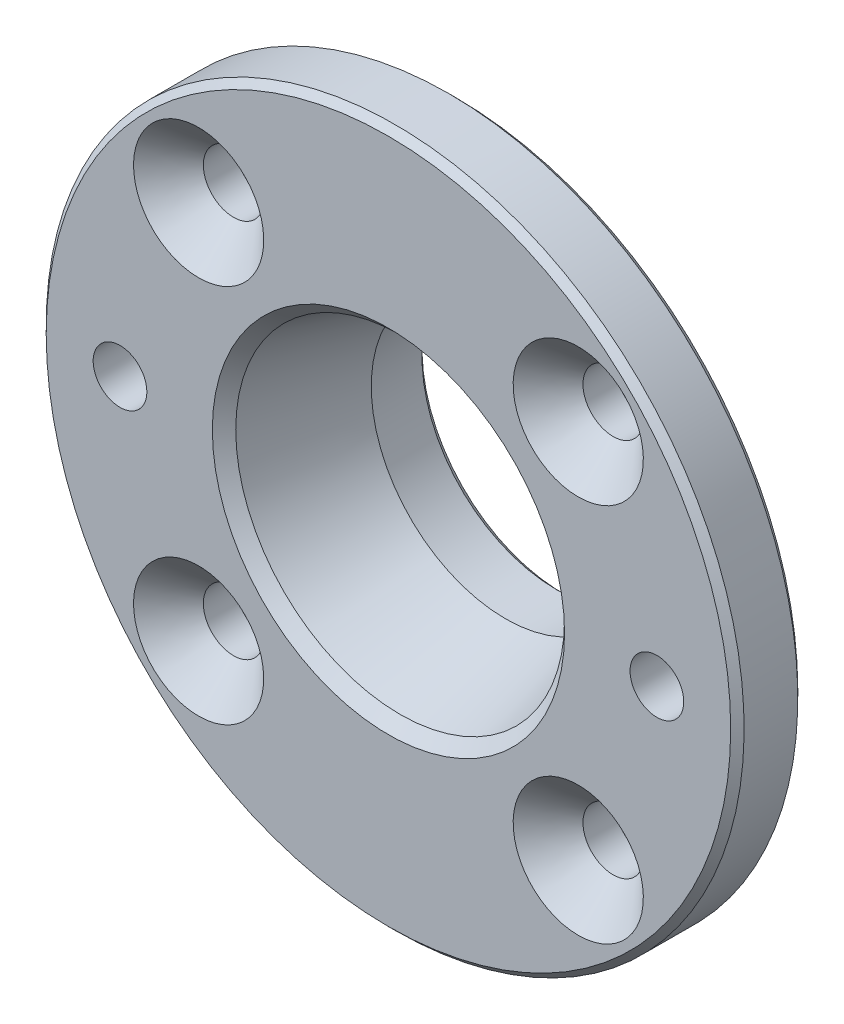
ISO-10303-21;
HEADER;
FILE_DESCRIPTION(('STEP AP214'),'2;1');
FILE_NAME('part.step','',(''),(''),'','','');
FILE_SCHEMA(('AUTOMOTIVE_DESIGN { 1 0 10303 214 1 1 1 1 }'));
ENDSEC;
DATA;
#1=APPLICATION_CONTEXT('core data for automotive mechanical design processes');
#2=APPLICATION_PROTOCOL_DEFINITION('international standard','automotive_design',2000,#1);
#3=PRODUCT_CONTEXT('',#1,'mechanical');
#4=PRODUCT('Part','Part','',(#3));
#5=PRODUCT_RELATED_PRODUCT_CATEGORY('part','',(#4));
#6=PRODUCT_DEFINITION_FORMATION('','',#4);
#7=PRODUCT_DEFINITION_CONTEXT('part definition',#1,'design');
#8=PRODUCT_DEFINITION('design','',#6,#7);
#9=PRODUCT_DEFINITION_SHAPE('','',#8);
#10=(LENGTH_UNIT() NAMED_UNIT(*) SI_UNIT(.MILLI.,.METRE.));
#11=(NAMED_UNIT(*) PLANE_ANGLE_UNIT() SI_UNIT($,.RADIAN.));
#12=(NAMED_UNIT(*) SI_UNIT($,.STERADIAN.) SOLID_ANGLE_UNIT());
#13=UNCERTAINTY_MEASURE_WITH_UNIT(LENGTH_MEASURE(1.E-05),#10,'distance_accuracy_value','');
#14=(GEOMETRIC_REPRESENTATION_CONTEXT(3) GLOBAL_UNCERTAINTY_ASSIGNED_CONTEXT((#13)) GLOBAL_UNIT_ASSIGNED_CONTEXT((#10,
#11,#12)) REPRESENTATION_CONTEXT('',''));
#15=CARTESIAN_POINT('',(0.,0.,0.));
#16=DIRECTION('',(0.,0.,1.));
#17=DIRECTION('',(1.,0.,0.));
#18=AXIS2_PLACEMENT_3D('',#15,#16,#17);
#19=CARTESIAN_POINT('',(0.,0.,-8.71853610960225));
#20=DIRECTION('',(0.,0.,1.));
#21=DIRECTION('',(0.,-1.,0.));
#22=AXIS2_PLACEMENT_3D('',#19,#20,#21);
#23=CONICAL_SURFACE('',#22,10.,0.279252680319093);
#24=CARTESIAN_POINT('',(0.,0.,-8.71853610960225));
#25=DIRECTION('',(0.,0.,1.));
#26=DIRECTION('',(0.,-1.,0.));
#27=AXIS2_PLACEMENT_3D('',#24,#25,#26);
#28=CIRCLE('',#27,10.);
#29=CARTESIAN_POINT('',(0.,-10.,-8.71853610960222));
#30=VERTEX_POINT('',#29);
#31=EDGE_CURVE('E58',#30,#30,#28,.T.);
#32=ORIENTED_EDGE('',*,*,#31,.F.);
#33=EDGE_LOOP('',(#32));
#34=FACE_BOUND('',#33,.T.);
#35=CARTESIAN_POINT('',(0.,0.,-0.871853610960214));
#36=DIRECTION('',(0.,0.,-1.));
#37=DIRECTION('',(-1.,0.,0.));
#38=AXIS2_PLACEMENT_3D('',#35,#36,#37);
#39=CIRCLE('',#38,12.25);
#40=CARTESIAN_POINT('',(-12.25,0.,-0.871853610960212));
#41=VERTEX_POINT('',#40);
#42=EDGE_CURVE('E103',#41,#41,#39,.T.);
#43=ORIENTED_EDGE('',*,*,#42,.F.);
#44=EDGE_LOOP('',(#43));
#45=FACE_BOUND('',#44,.T.);
#46=ADVANCED_FACE('F14',(#34,#45),#23,.F.);
#47=CARTESIAN_POINT('',(0.,0.,0.));
#48=DIRECTION('',(0.,0.,1.));
#49=DIRECTION('',(0.,-1.,0.));
#50=AXIS2_PLACEMENT_3D('',#47,#48,#49);
#51=CYLINDRICAL_SURFACE('',#50,10.);
#52=CARTESIAN_POINT('',(0.,0.,-12.5));
#53=DIRECTION('',(0.,0.,-1.));
#54=DIRECTION('',(0.,1.,0.));
#55=AXIS2_PLACEMENT_3D('',#52,#53,#54);
#56=CIRCLE('',#55,10.);
#57=CARTESIAN_POINT('',(0.,9.99999999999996,-12.5));
#58=VERTEX_POINT('',#57);
#59=EDGE_CURVE('E34',#58,#58,#56,.T.);
#60=ORIENTED_EDGE('',*,*,#59,.T.);
#61=EDGE_LOOP('',(#60));
#62=FACE_BOUND('',#61,.T.);
#63=ORIENTED_EDGE('',*,*,#31,.T.);
#64=EDGE_LOOP('',(#63));
#65=FACE_BOUND('',#64,.T.);
#66=ADVANCED_FACE('F159',(#62,#65),#51,.F.);
#67=CARTESIAN_POINT('',(10.,0.,-13.));
#68=DIRECTION('',(0.,0.,-1.));
#69=DIRECTION('',(0.,1.,0.));
#70=AXIS2_PLACEMENT_3D('',#67,#68,#69);
#71=PLANE('',#70);
#72=CARTESIAN_POINT('',(0.,0.,-13.));
#73=DIRECTION('',(0.,0.,-1.));
#74=DIRECTION('',(0.,1.,0.));
#75=AXIS2_PLACEMENT_3D('',#72,#73,#74);
#76=CIRCLE('',#75,10.5);
#77=CARTESIAN_POINT('',(0.,10.5,-13.));
#78=VERTEX_POINT('',#77);
#79=EDGE_CURVE('E37',#78,#78,#76,.F.);
#80=ORIENTED_EDGE('',*,*,#79,.T.);
#81=EDGE_LOOP('',(#80));
#82=FACE_BOUND('',#81,.T.);
#83=CARTESIAN_POINT('',(0.,0.,-13.));
#84=DIRECTION('',(0.,0.,-1.));
#85=DIRECTION('',(0.,1.,0.));
#86=AXIS2_PLACEMENT_3D('',#83,#84,#85);
#87=CIRCLE('',#86,13.4);
#88=CARTESIAN_POINT('',(0.,13.4,-13.));
#89=VERTEX_POINT('',#88);
#90=EDGE_CURVE('E40',#89,#89,#87,.T.);
#91=ORIENTED_EDGE('',*,*,#90,.T.);
#92=EDGE_LOOP('',(#91));
#93=FACE_BOUND('',#92,.T.);
#94=ADVANCED_FACE('F165',(#82,#93),#71,.T.);
#95=CARTESIAN_POINT('',(0.,0.,0.));
#96=DIRECTION('',(0.,0.,1.));
#97=DIRECTION('',(0.,-1.,0.));
#98=AXIS2_PLACEMENT_3D('',#95,#96,#97);
#99=CYLINDRICAL_SURFACE('',#98,14.);
#100=CARTESIAN_POINT('',(0.,0.,-7.));
#101=DIRECTION('',(0.,0.,1.));
#102=DIRECTION('',(0.,-1.,0.));
#103=AXIS2_PLACEMENT_3D('',#100,#101,#102);
#104=CIRCLE('',#103,14.);
#105=CARTESIAN_POINT('',(0.,-14.,-6.99999999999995));
#106=VERTEX_POINT('',#105);
#107=EDGE_CURVE('E76',#106,#106,#104,.T.);
#108=ORIENTED_EDGE('',*,*,#107,.F.);
#109=EDGE_LOOP('',(#108));
#110=FACE_BOUND('',#109,.T.);
#111=CARTESIAN_POINT('',(0.,0.,-10.9));
#112=DIRECTION('',(0.,0.,1.));
#113=DIRECTION('',(0.,-1.,0.));
#114=AXIS2_PLACEMENT_3D('',#111,#112,#113);
#115=CIRCLE('',#114,14.);
#116=CARTESIAN_POINT('',(0.,-14.,-10.9));
#117=VERTEX_POINT('',#116);
#118=EDGE_CURVE('E61',#117,#117,#115,.T.);
#119=ORIENTED_EDGE('',*,*,#118,.T.);
#120=EDGE_LOOP('',(#119));
#121=FACE_BOUND('',#120,.T.);
#122=ADVANCED_FACE('F173',(#110,#121),#99,.T.);
#123=CARTESIAN_POINT('',(14.,0.,-5.));
#124=DIRECTION('',(0.,0.,-1.));
#125=DIRECTION('',(0.,1.,0.));
#126=AXIS2_PLACEMENT_3D('',#123,#124,#125);
#127=PLANE('',#126);
#128=CARTESIAN_POINT('',(-20.,0.,-5.));
#129=DIRECTION('',(0.,0.,-1.));
#130=DIRECTION('',(0.,1.,0.));
#131=AXIS2_PLACEMENT_3D('',#128,#129,#130);
#132=CIRCLE('',#131,2.);
#133=CARTESIAN_POINT('',(-20.,2.,-5.00000000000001));
#134=VERTEX_POINT('',#133);
#135=EDGE_CURVE('E109',#134,#134,#132,.T.);
#136=ORIENTED_EDGE('',*,*,#135,.F.);
#137=EDGE_LOOP('',(#136));
#138=FACE_BOUND('',#137,.T.);
#139=CARTESIAN_POINT('',(20.,2.8796409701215E-13,-5.));
#140=DIRECTION('',(0.,0.,-1.));
#141=DIRECTION('',(0.,1.,0.));
#142=AXIS2_PLACEMENT_3D('',#139,#140,#141);
#143=CIRCLE('',#142,2.);
#144=CARTESIAN_POINT('',(20.,2.00000000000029,-5.00000000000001));
#145=VERTEX_POINT('',#144);
#146=EDGE_CURVE('E112',#145,#145,#143,.T.);
#147=ORIENTED_EDGE('',*,*,#146,.F.);
#148=EDGE_LOOP('',(#147));
#149=FACE_BOUND('',#148,.T.);
#150=CARTESIAN_POINT('',(14.1421356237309,14.142135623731,-5.));
#151=DIRECTION('',(0.,0.,-1.));
#152=DIRECTION('',(0.,1.,0.));
#153=AXIS2_PLACEMENT_3D('',#150,#151,#152);
#154=CIRCLE('',#153,2.25);
#155=CARTESIAN_POINT('',(14.1421356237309,16.392135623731,-5.00000000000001));
#156=VERTEX_POINT('',#155);
#157=EDGE_CURVE('E9',#156,#156,#154,.T.);
#158=ORIENTED_EDGE('',*,*,#157,.F.);
#159=EDGE_LOOP('',(#158));
#160=FACE_BOUND('',#159,.T.);
#161=CARTESIAN_POINT('',(-14.142135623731,14.1421356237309,-5.));
#162=DIRECTION('',(0.,0.,-1.));
#163=DIRECTION('',(0.,1.,0.));
#164=AXIS2_PLACEMENT_3D('',#161,#162,#163);
#165=CIRCLE('',#164,2.25);
#166=CARTESIAN_POINT('',(-14.142135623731,16.3921356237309,-5.00000000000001));
#167=VERTEX_POINT('',#166);
#168=EDGE_CURVE('E22',#167,#167,#165,.T.);
#169=ORIENTED_EDGE('',*,*,#168,.F.);
#170=EDGE_LOOP('',(#169));
#171=FACE_BOUND('',#170,.T.);
#172=CARTESIAN_POINT('',(-14.1421356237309,-14.142135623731,-5.));
#173=DIRECTION('',(0.,0.,-1.));
#174=DIRECTION('',(0.,1.,0.));
#175=AXIS2_PLACEMENT_3D('',#172,#173,#174);
#176=CIRCLE('',#175,2.25);
#177=CARTESIAN_POINT('',(-14.1421356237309,-11.892135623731,-5.00000000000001));
#178=VERTEX_POINT('',#177);
#179=EDGE_CURVE('E26',#178,#178,#176,.T.);
#180=ORIENTED_EDGE('',*,*,#179,.F.);
#181=EDGE_LOOP('',(#180));
#182=FACE_BOUND('',#181,.T.);
#183=CARTESIAN_POINT('',(14.142135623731,-14.1421356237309,-5.));
#184=DIRECTION('',(0.,0.,-1.));
#185=DIRECTION('',(0.,1.,0.));
#186=AXIS2_PLACEMENT_3D('',#183,#184,#185);
#187=CIRCLE('',#186,2.25);
#188=CARTESIAN_POINT('',(14.142135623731,-11.8921356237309,-5.00000000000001));
#189=VERTEX_POINT('',#188);
#190=EDGE_CURVE('E31',#189,#189,#187,.T.);
#191=ORIENTED_EDGE('',*,*,#190,.F.);
#192=EDGE_LOOP('',(#191));
#193=FACE_BOUND('',#192,.T.);
#194=CARTESIAN_POINT('',(0.,0.,-5.));
#195=DIRECTION('',(0.,0.,1.));
#196=DIRECTION('',(0.,-1.,0.));
#197=AXIS2_PLACEMENT_3D('',#194,#195,#196);
#198=CIRCLE('',#197,15.);
#199=CARTESIAN_POINT('',(0.,-15.,-4.99999999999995));
#200=VERTEX_POINT('',#199);
#201=EDGE_CURVE('E67',#200,#200,#198,.T.);
#202=ORIENTED_EDGE('',*,*,#201,.T.);
#203=EDGE_LOOP('',(#202));
#204=FACE_BOUND('',#203,.T.);
#205=CARTESIAN_POINT('',(0.,0.,-5.));
#206=DIRECTION('',(0.,0.,-1.));
#207=DIRECTION('',(0.,1.,0.));
#208=AXIS2_PLACEMENT_3D('',#205,#206,#207);
#209=CIRCLE('',#208,25.5);
#210=CARTESIAN_POINT('',(0.,25.5,-5.00000000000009));
#211=VERTEX_POINT('',#210);
#212=EDGE_CURVE('E46',#211,#211,#209,.T.);
#213=ORIENTED_EDGE('',*,*,#212,.T.);
#214=EDGE_LOOP('',(#213));
#215=FACE_BOUND('',#214,.T.);
#216=ADVANCED_FACE('F177',(#138,#149,#160,#171,#182,#193,#204,#215),#127,.T.);
#217=CARTESIAN_POINT('',(0.,0.,0.));
#218=DIRECTION('',(0.,0.,1.));
#219=DIRECTION('',(0.,-1.,0.));
#220=AXIS2_PLACEMENT_3D('',#217,#218,#219);
#221=CYLINDRICAL_SURFACE('',#220,26.);
#222=CARTESIAN_POINT('',(0.,0.,-0.500000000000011));
#223=DIRECTION('',(0.,0.,1.));
#224=DIRECTION('',(0.,-1.,0.));
#225=AXIS2_PLACEMENT_3D('',#222,#223,#224);
#226=CIRCLE('',#225,26.);
#227=CARTESIAN_POINT('',(0.,-26.,-0.49999999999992));
#228=VERTEX_POINT('',#227);
#229=EDGE_CURVE('E49',#228,#228,#226,.F.);
#230=ORIENTED_EDGE('',*,*,#229,.T.);
#231=EDGE_LOOP('',(#230));
#232=FACE_BOUND('',#231,.T.);
#233=CARTESIAN_POINT('',(0.,0.,-4.5));
#234=DIRECTION('',(0.,0.,-1.));
#235=DIRECTION('',(0.,1.,0.));
#236=AXIS2_PLACEMENT_3D('',#233,#234,#235);
#237=CIRCLE('',#236,26.);
#238=CARTESIAN_POINT('',(0.,26.,-4.50000000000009));
#239=VERTEX_POINT('',#238);
#240=EDGE_CURVE('E52',#239,#239,#237,.F.);
#241=ORIENTED_EDGE('',*,*,#240,.T.);
#242=EDGE_LOOP('',(#241));
#243=FACE_BOUND('',#242,.T.);
#244=ADVANCED_FACE('F128',(#232,#243),#221,.T.);
#245=CARTESIAN_POINT('',(12.5,0.,0.));
#246=DIRECTION('',(0.,0.,1.));
#247=DIRECTION('',(0.,-1.,0.));
#248=AXIS2_PLACEMENT_3D('',#245,#246,#247);
#249=PLANE('',#248);
#250=CARTESIAN_POINT('',(-20.,0.,0.));
#251=DIRECTION('',(0.,0.,1.));
#252=DIRECTION('',(1.,0.,0.));
#253=AXIS2_PLACEMENT_3D('',#250,#251,#252);
#254=CIRCLE('',#253,2.);
#255=CARTESIAN_POINT('',(-18.,0.,0.));
#256=VERTEX_POINT('',#255);
#257=EDGE_CURVE('E115',#256,#256,#254,.T.);
#258=ORIENTED_EDGE('',*,*,#257,.F.);
#259=EDGE_LOOP('',(#258));
#260=FACE_BOUND('',#259,.T.);
#261=CARTESIAN_POINT('',(20.,2.8796409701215E-13,0.));
#262=DIRECTION('',(0.,0.,1.));
#263=DIRECTION('',(1.,0.,0.));
#264=AXIS2_PLACEMENT_3D('',#261,#262,#263);
#265=CIRCLE('',#264,2.);
#266=CARTESIAN_POINT('',(22.,2.8796409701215E-13,0.));
#267=VERTEX_POINT('',#266);
#268=EDGE_CURVE('E116',#267,#267,#265,.T.);
#269=ORIENTED_EDGE('',*,*,#268,.F.);
#270=EDGE_LOOP('',(#269));
#271=FACE_BOUND('',#270,.T.);
#272=CARTESIAN_POINT('',(0.,0.,0.));
#273=DIRECTION('',(0.,0.,-1.));
#274=DIRECTION('',(-1.,0.,0.));
#275=AXIS2_PLACEMENT_3D('',#272,#273,#274);
#276=CIRCLE('',#275,13.1218536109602);
#277=CARTESIAN_POINT('',(-13.1218536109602,0.,0.));
#278=VERTEX_POINT('',#277);
#279=EDGE_CURVE('E106',#278,#278,#276,.T.);
#280=ORIENTED_EDGE('',*,*,#279,.T.);
#281=EDGE_LOOP('',(#280));
#282=FACE_BOUND('',#281,.T.);
#283=CARTESIAN_POINT('',(14.1421356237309,14.142135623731,0.));
#284=DIRECTION('',(0.,0.,1.));
#285=DIRECTION('',(0.,-1.,0.));
#286=AXIS2_PLACEMENT_3D('',#283,#284,#285);
#287=CIRCLE('',#286,4.85);
#288=CARTESIAN_POINT('',(14.1421356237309,9.29213562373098,0.));
#289=VERTEX_POINT('',#288);
#290=EDGE_CURVE('E100',#289,#289,#287,.T.);
#291=ORIENTED_EDGE('',*,*,#290,.F.);
#292=EDGE_LOOP('',(#291));
#293=FACE_BOUND('',#292,.T.);
#294=CARTESIAN_POINT('',(14.142135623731,-14.1421356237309,0.));
#295=DIRECTION('',(0.,0.,1.));
#296=DIRECTION('',(0.,-1.,0.));
#297=AXIS2_PLACEMENT_3D('',#294,#295,#296);
#298=CIRCLE('',#297,4.85);
#299=CARTESIAN_POINT('',(14.142135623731,-18.9921356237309,0.));
#300=VERTEX_POINT('',#299);
#301=EDGE_CURVE('E94',#300,#300,#298,.T.);
#302=ORIENTED_EDGE('',*,*,#301,.F.);
#303=EDGE_LOOP('',(#302));
#304=FACE_BOUND('',#303,.T.);
#305=CARTESIAN_POINT('',(-14.1421356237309,-14.142135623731,0.));
#306=DIRECTION('',(0.,0.,1.));
#307=DIRECTION('',(0.,-1.,0.));
#308=AXIS2_PLACEMENT_3D('',#305,#306,#307);
#309=CIRCLE('',#308,4.85);
#310=CARTESIAN_POINT('',(-14.1421356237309,-18.992135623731,0.));
#311=VERTEX_POINT('',#310);
#312=EDGE_CURVE('E88',#311,#311,#309,.T.);
#313=ORIENTED_EDGE('',*,*,#312,.F.);
#314=EDGE_LOOP('',(#313));
#315=FACE_BOUND('',#314,.T.);
#316=CARTESIAN_POINT('',(-14.142135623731,14.1421356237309,0.));
#317=DIRECTION('',(0.,0.,1.));
#318=DIRECTION('',(0.,-1.,0.));
#319=AXIS2_PLACEMENT_3D('',#316,#317,#318);
#320=CIRCLE('',#319,4.85);
#321=CARTESIAN_POINT('',(-14.142135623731,9.29213562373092,0.));
#322=VERTEX_POINT('',#321);
#323=EDGE_CURVE('E82',#322,#322,#320,.T.);
#324=ORIENTED_EDGE('',*,*,#323,.F.);
#325=EDGE_LOOP('',(#324));
#326=FACE_BOUND('',#325,.T.);
#327=CARTESIAN_POINT('',(0.,0.,0.));
#328=DIRECTION('',(0.,0.,1.));
#329=DIRECTION('',(0.,-1.,0.));
#330=AXIS2_PLACEMENT_3D('',#327,#328,#329);
#331=CIRCLE('',#330,25.5);
#332=CARTESIAN_POINT('',(0.,-25.5,0.));
#333=VERTEX_POINT('',#332);
#334=EDGE_CURVE('E55',#333,#333,#331,.T.);
#335=ORIENTED_EDGE('',*,*,#334,.T.);
#336=EDGE_LOOP('',(#335));
#337=FACE_BOUND('',#336,.T.);
#338=ADVANCED_FACE('F124',(#260,#271,#282,#293,#304,#315,#326,#337),#249,.T.);
#339=CARTESIAN_POINT('',(0.,0.,0.));
#340=DIRECTION('',(0.,0.,-1.));
#341=DIRECTION('',(0.,1.,0.));
#342=AXIS2_PLACEMENT_3D('',#339,#340,#341);
#343=CONICAL_SURFACE('',#342,25.5,0.785398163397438);
#344=ORIENTED_EDGE('',*,*,#229,.F.);
#345=EDGE_LOOP('',(#344));
#346=FACE_BOUND('',#345,.T.);
#347=ORIENTED_EDGE('',*,*,#334,.F.);
#348=EDGE_LOOP('',(#347));
#349=FACE_BOUND('',#348,.T.);
#350=ADVANCED_FACE('F127',(#346,#349),#343,.T.);
#351=CARTESIAN_POINT('',(0.,0.,-4.5));
#352=DIRECTION('',(0.,0.,1.));
#353=DIRECTION('',(0.,-1.,0.));
#354=AXIS2_PLACEMENT_3D('',#351,#352,#353);
#355=CONICAL_SURFACE('',#354,26.,0.785398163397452);
#356=ORIENTED_EDGE('',*,*,#212,.F.);
#357=EDGE_LOOP('',(#356));
#358=FACE_BOUND('',#357,.T.);
#359=ORIENTED_EDGE('',*,*,#240,.F.);
#360=EDGE_LOOP('',(#359));
#361=FACE_BOUND('',#360,.T.);
#362=ADVANCED_FACE('F145',(#358,#361),#355,.T.);
#363=CARTESIAN_POINT('',(0.,0.,-11.));
#364=DIRECTION('',(0.,0.,1.));
#365=DIRECTION('',(0.,-1.,0.));
#366=AXIS2_PLACEMENT_3D('',#363,#364,#365);
#367=CONICAL_SURFACE('',#366,13.9,0.785398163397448);
#368=ORIENTED_EDGE('',*,*,#118,.F.);
#369=EDGE_LOOP('',(#368));
#370=FACE_BOUND('',#369,.T.);
#371=CARTESIAN_POINT('',(0.,0.,-11.));
#372=DIRECTION('',(0.,0.,1.));
#373=DIRECTION('',(0.,-1.,0.));
#374=AXIS2_PLACEMENT_3D('',#371,#372,#373);
#375=CIRCLE('',#374,13.9);
#376=CARTESIAN_POINT('',(0.,-13.9,-11.));
#377=VERTEX_POINT('',#376);
#378=EDGE_CURVE('E64',#377,#377,#375,.T.);
#379=ORIENTED_EDGE('',*,*,#378,.T.);
#380=EDGE_LOOP('',(#379));
#381=FACE_BOUND('',#380,.T.);
#382=ADVANCED_FACE('F153',(#370,#381),#367,.T.);
#383=CARTESIAN_POINT('',(0.,0.,0.));
#384=DIRECTION('',(0.,0.,1.));
#385=DIRECTION('',(0.,-1.,0.));
#386=AXIS2_PLACEMENT_3D('',#383,#384,#385);
#387=CYLINDRICAL_SURFACE('',#386,13.9);
#388=CARTESIAN_POINT('',(0.,0.,-12.5));
#389=DIRECTION('',(0.,0.,-1.));
#390=DIRECTION('',(0.,1.,0.));
#391=AXIS2_PLACEMENT_3D('',#388,#389,#390);
#392=CIRCLE('',#391,13.9);
#393=CARTESIAN_POINT('',(0.,13.9,-12.5));
#394=VERTEX_POINT('',#393);
#395=EDGE_CURVE('E43',#394,#394,#392,.F.);
#396=ORIENTED_EDGE('',*,*,#395,.T.);
#397=EDGE_LOOP('',(#396));
#398=FACE_BOUND('',#397,.T.);
#399=ORIENTED_EDGE('',*,*,#378,.F.);
#400=EDGE_LOOP('',(#399));
#401=FACE_BOUND('',#400,.T.);
#402=ADVANCED_FACE('F187',(#398,#401),#387,.T.);
#403=CARTESIAN_POINT('',(0.,0.,-12.5));
#404=DIRECTION('',(0.,0.,1.));
#405=DIRECTION('',(0.,-1.,0.));
#406=AXIS2_PLACEMENT_3D('',#403,#404,#405);
#407=CONICAL_SURFACE('',#406,13.9,0.785398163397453);
#408=ORIENTED_EDGE('',*,*,#90,.F.);
#409=EDGE_LOOP('',(#408));
#410=FACE_BOUND('',#409,.T.);
#411=ORIENTED_EDGE('',*,*,#395,.F.);
#412=EDGE_LOOP('',(#411));
#413=FACE_BOUND('',#412,.T.);
#414=ADVANCED_FACE('F191',(#410,#413),#407,.T.);
#415=CARTESIAN_POINT('',(0.,0.,-4.5));
#416=DIRECTION('',(0.,0.,-1.));
#417=DIRECTION('',(0.,1.,0.));
#418=AXIS2_PLACEMENT_3D('',#415,#416,#417);
#419=CONICAL_SURFACE('',#418,14.5,0.785398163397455);
#420=ORIENTED_EDGE('',*,*,#201,.F.);
#421=EDGE_LOOP('',(#420));
#422=FACE_BOUND('',#421,.T.);
#423=CARTESIAN_POINT('',(0.,0.,-4.5));
#424=DIRECTION('',(0.,0.,1.));
#425=DIRECTION('',(0.,-1.,0.));
#426=AXIS2_PLACEMENT_3D('',#423,#424,#425);
#427=CIRCLE('',#426,14.5);
#428=CARTESIAN_POINT('',(0.,-14.5,-4.49999999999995));
#429=VERTEX_POINT('',#428);
#430=EDGE_CURVE('E70',#429,#429,#427,.T.);
#431=ORIENTED_EDGE('',*,*,#430,.T.);
#432=EDGE_LOOP('',(#431));
#433=FACE_BOUND('',#432,.T.);
#434=ADVANCED_FACE('F193',(#422,#433),#419,.F.);
#435=CARTESIAN_POINT('',(13.5,0.,-4.5));
#436=DIRECTION('',(0.,0.,1.));
#437=DIRECTION('',(0.,-1.,0.));
#438=AXIS2_PLACEMENT_3D('',#435,#436,#437);
#439=PLANE('',#438);
#440=CARTESIAN_POINT('',(0.,0.,-4.5));
#441=DIRECTION('',(0.,0.,1.));
#442=DIRECTION('',(0.,-1.,0.));
#443=AXIS2_PLACEMENT_3D('',#440,#441,#442);
#444=CIRCLE('',#443,13.5);
#445=CARTESIAN_POINT('',(0.,-13.5,-4.49999999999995));
#446=VERTEX_POINT('',#445);
#447=EDGE_CURVE('E18',#446,#446,#444,.T.);
#448=ORIENTED_EDGE('',*,*,#447,.T.);
#449=EDGE_LOOP('',(#448));
#450=FACE_BOUND('',#449,.T.);
#451=ORIENTED_EDGE('',*,*,#430,.F.);
#452=EDGE_LOOP('',(#451));
#453=FACE_BOUND('',#452,.T.);
#454=ADVANCED_FACE('F196',(#450,#453),#439,.F.);
#455=CARTESIAN_POINT('',(0.,0.,0.));
#456=DIRECTION('',(0.,0.,1.));
#457=DIRECTION('',(0.,-1.,0.));
#458=AXIS2_PLACEMENT_3D('',#455,#456,#457);
#459=CYLINDRICAL_SURFACE('',#458,13.5);
#460=ORIENTED_EDGE('',*,*,#447,.F.);
#461=EDGE_LOOP('',(#460));
#462=FACE_BOUND('',#461,.T.);
#463=CARTESIAN_POINT('',(0.,0.,-6.5));
#464=DIRECTION('',(0.,0.,1.));
#465=DIRECTION('',(0.,-1.,0.));
#466=AXIS2_PLACEMENT_3D('',#463,#464,#465);
#467=CIRCLE('',#466,13.5);
#468=CARTESIAN_POINT('',(0.,-13.5,-6.49999999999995));
#469=VERTEX_POINT('',#468);
#470=EDGE_CURVE('E73',#469,#469,#467,.T.);
#471=ORIENTED_EDGE('',*,*,#470,.T.);
#472=EDGE_LOOP('',(#471));
#473=FACE_BOUND('',#472,.T.);
#474=ADVANCED_FACE('F200',(#462,#473),#459,.T.);
#475=CARTESIAN_POINT('',(0.,0.,-7.));
#476=DIRECTION('',(0.,0.,-1.));
#477=DIRECTION('',(0.,1.,0.));
#478=AXIS2_PLACEMENT_3D('',#475,#476,#477);
#479=CONICAL_SURFACE('',#478,14.,0.785398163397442);
#480=ORIENTED_EDGE('',*,*,#470,.F.);
#481=EDGE_LOOP('',(#480));
#482=FACE_BOUND('',#481,.T.);
#483=ORIENTED_EDGE('',*,*,#107,.T.);
#484=EDGE_LOOP('',(#483));
#485=FACE_BOUND('',#484,.T.);
#486=ADVANCED_FACE('F204',(#482,#485),#479,.T.);
#487=CARTESIAN_POINT('',(-14.142135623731,14.1421356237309,0.));
#488=DIRECTION('',(0.,0.,1.));
#489=DIRECTION('',(0.,-1.,0.));
#490=AXIS2_PLACEMENT_3D('',#487,#488,#489);
#491=CYLINDRICAL_SURFACE('',#490,2.25);
#492=CARTESIAN_POINT('',(-14.142135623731,14.1421356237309,-2.60000000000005));
#493=DIRECTION('',(0.,0.,1.));
#494=DIRECTION('',(0.,-1.,0.));
#495=AXIS2_PLACEMENT_3D('',#492,#493,#494);
#496=CIRCLE('',#495,2.25);
#497=CARTESIAN_POINT('',(-14.142135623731,11.8921356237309,-2.60000000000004));
#498=VERTEX_POINT('',#497);
#499=EDGE_CURVE('E79',#498,#498,#496,.T.);
#500=ORIENTED_EDGE('',*,*,#499,.T.);
#501=EDGE_LOOP('',(#500));
#502=FACE_BOUND('',#501,.T.);
#503=ORIENTED_EDGE('',*,*,#168,.T.);
#504=EDGE_LOOP('',(#503));
#505=FACE_BOUND('',#504,.T.);
#506=ADVANCED_FACE('F208',(#502,#505),#491,.F.);
#507=CARTESIAN_POINT('',(-14.142135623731,14.1421356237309,0.));
#508=DIRECTION('',(0.,0.,1.));
#509=DIRECTION('',(0.,-1.,0.));
#510=AXIS2_PLACEMENT_3D('',#507,#508,#509);
#511=CONICAL_SURFACE('',#510,4.85,0.785398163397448);
#512=ORIENTED_EDGE('',*,*,#499,.F.);
#513=EDGE_LOOP('',(#512));
#514=FACE_BOUND('',#513,.T.);
#515=ORIENTED_EDGE('',*,*,#323,.T.);
#516=EDGE_LOOP('',(#515));
#517=FACE_BOUND('',#516,.T.);
#518=ADVANCED_FACE('F210',(#514,#517),#511,.F.);
#519=CARTESIAN_POINT('',(-14.1421356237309,-14.142135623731,0.));
#520=DIRECTION('',(0.,0.,1.));
#521=DIRECTION('',(0.,-1.,0.));
#522=AXIS2_PLACEMENT_3D('',#519,#520,#521);
#523=CYLINDRICAL_SURFACE('',#522,2.25);
#524=CARTESIAN_POINT('',(-14.1421356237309,-14.142135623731,-2.59999999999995));
#525=DIRECTION('',(0.,0.,1.));
#526=DIRECTION('',(0.,-1.,0.));
#527=AXIS2_PLACEMENT_3D('',#524,#525,#526);
#528=CIRCLE('',#527,2.25);
#529=CARTESIAN_POINT('',(-14.1421356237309,-16.392135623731,-2.59999999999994));
#530=VERTEX_POINT('',#529);
#531=EDGE_CURVE('E85',#530,#530,#528,.T.);
#532=ORIENTED_EDGE('',*,*,#531,.T.);
#533=EDGE_LOOP('',(#532));
#534=FACE_BOUND('',#533,.T.);
#535=ORIENTED_EDGE('',*,*,#179,.T.);
#536=EDGE_LOOP('',(#535));
#537=FACE_BOUND('',#536,.T.);
#538=ADVANCED_FACE('F213',(#534,#537),#523,.F.);
#539=CARTESIAN_POINT('',(-14.1421356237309,-14.142135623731,0.));
#540=DIRECTION('',(0.,0.,1.));
#541=DIRECTION('',(0.,-1.,0.));
#542=AXIS2_PLACEMENT_3D('',#539,#540,#541);
#543=CONICAL_SURFACE('',#542,4.85,0.785398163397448);
#544=ORIENTED_EDGE('',*,*,#531,.F.);
#545=EDGE_LOOP('',(#544));
#546=FACE_BOUND('',#545,.T.);
#547=ORIENTED_EDGE('',*,*,#312,.T.);
#548=EDGE_LOOP('',(#547));
#549=FACE_BOUND('',#548,.T.);
#550=ADVANCED_FACE('F215',(#546,#549),#543,.F.);
#551=CARTESIAN_POINT('',(14.142135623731,-14.1421356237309,0.));
#552=DIRECTION('',(0.,0.,1.));
#553=DIRECTION('',(0.,-1.,0.));
#554=AXIS2_PLACEMENT_3D('',#551,#552,#553);
#555=CYLINDRICAL_SURFACE('',#554,2.25);
#556=CARTESIAN_POINT('',(14.142135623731,-14.1421356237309,-2.59999999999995));
#557=DIRECTION('',(0.,0.,1.));
#558=DIRECTION('',(0.,-1.,0.));
#559=AXIS2_PLACEMENT_3D('',#556,#557,#558);
#560=CIRCLE('',#559,2.25);
#561=CARTESIAN_POINT('',(14.142135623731,-16.3921356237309,-2.59999999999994));
#562=VERTEX_POINT('',#561);
#563=EDGE_CURVE('E91',#562,#562,#560,.T.);
#564=ORIENTED_EDGE('',*,*,#563,.T.);
#565=EDGE_LOOP('',(#564));
#566=FACE_BOUND('',#565,.T.);
#567=ORIENTED_EDGE('',*,*,#190,.T.);
#568=EDGE_LOOP('',(#567));
#569=FACE_BOUND('',#568,.T.);
#570=ADVANCED_FACE('F218',(#566,#569),#555,.F.);
#571=CARTESIAN_POINT('',(14.142135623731,-14.1421356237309,0.));
#572=DIRECTION('',(0.,0.,1.));
#573=DIRECTION('',(0.,-1.,0.));
#574=AXIS2_PLACEMENT_3D('',#571,#572,#573);
#575=CONICAL_SURFACE('',#574,4.85,0.785398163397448);
#576=ORIENTED_EDGE('',*,*,#563,.F.);
#577=EDGE_LOOP('',(#576));
#578=FACE_BOUND('',#577,.T.);
#579=ORIENTED_EDGE('',*,*,#301,.T.);
#580=EDGE_LOOP('',(#579));
#581=FACE_BOUND('',#580,.T.);
#582=ADVANCED_FACE('F220',(#578,#581),#575,.F.);
#583=CARTESIAN_POINT('',(14.1421356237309,14.142135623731,0.));
#584=DIRECTION('',(0.,0.,1.));
#585=DIRECTION('',(0.,-1.,0.));
#586=AXIS2_PLACEMENT_3D('',#583,#584,#585);
#587=CYLINDRICAL_SURFACE('',#586,2.25);
#588=CARTESIAN_POINT('',(14.1421356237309,14.142135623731,-2.60000000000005));
#589=DIRECTION('',(0.,0.,1.));
#590=DIRECTION('',(0.,-1.,0.));
#591=AXIS2_PLACEMENT_3D('',#588,#589,#590);
#592=CIRCLE('',#591,2.25);
#593=CARTESIAN_POINT('',(14.1421356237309,11.892135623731,-2.60000000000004));
#594=VERTEX_POINT('',#593);
#595=EDGE_CURVE('E97',#594,#594,#592,.T.);
#596=ORIENTED_EDGE('',*,*,#595,.T.);
#597=EDGE_LOOP('',(#596));
#598=FACE_BOUND('',#597,.T.);
#599=ORIENTED_EDGE('',*,*,#157,.T.);
#600=EDGE_LOOP('',(#599));
#601=FACE_BOUND('',#600,.T.);
#602=ADVANCED_FACE('F16',(#598,#601),#587,.F.);
#603=CARTESIAN_POINT('',(14.1421356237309,14.142135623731,0.));
#604=DIRECTION('',(0.,0.,1.));
#605=DIRECTION('',(0.,-1.,0.));
#606=AXIS2_PLACEMENT_3D('',#603,#604,#605);
#607=CONICAL_SURFACE('',#606,4.85,0.785398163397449);
#608=ORIENTED_EDGE('',*,*,#595,.F.);
#609=EDGE_LOOP('',(#608));
#610=FACE_BOUND('',#609,.T.);
#611=ORIENTED_EDGE('',*,*,#290,.T.);
#612=EDGE_LOOP('',(#611));
#613=FACE_BOUND('',#612,.T.);
#614=ADVANCED_FACE('F224',(#610,#613),#607,.F.);
#615=CARTESIAN_POINT('',(0.,0.,-13.));
#616=DIRECTION('',(0.,0.,-1.));
#617=DIRECTION('',(0.,1.,0.));
#618=AXIS2_PLACEMENT_3D('',#615,#616,#617);
#619=CONICAL_SURFACE('',#618,10.5,0.785398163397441);
#620=ORIENTED_EDGE('',*,*,#59,.F.);
#621=EDGE_LOOP('',(#620));
#622=FACE_BOUND('',#621,.T.);
#623=ORIENTED_EDGE('',*,*,#79,.F.);
#624=EDGE_LOOP('',(#623));
#625=FACE_BOUND('',#624,.T.);
#626=ADVANCED_FACE('F227',(#622,#625),#619,.F.);
#627=CARTESIAN_POINT('',(0.,0.,0.));
#628=DIRECTION('',(0.,0.,1.));
#629=DIRECTION('',(1.,0.,0.));
#630=AXIS2_PLACEMENT_3D('',#627,#628,#629);
#631=CONICAL_SURFACE('',#630,13.1218536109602,0.78539816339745);
#632=ORIENTED_EDGE('',*,*,#42,.T.);
#633=EDGE_LOOP('',(#632));
#634=FACE_BOUND('',#633,.T.);
#635=ORIENTED_EDGE('',*,*,#279,.F.);
#636=EDGE_LOOP('',(#635));
#637=FACE_BOUND('',#636,.T.);
#638=ADVANCED_FACE('F229',(#634,#637),#631,.F.);
#639=CARTESIAN_POINT('',(20.,2.8796409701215E-13,-13.));
#640=DIRECTION('',(0.,0.,1.));
#641=DIRECTION('',(1.,0.,0.));
#642=AXIS2_PLACEMENT_3D('',#639,#640,#641);
#643=CYLINDRICAL_SURFACE('',#642,2.);
#644=ORIENTED_EDGE('',*,*,#146,.T.);
#645=EDGE_LOOP('',(#644));
#646=FACE_BOUND('',#645,.T.);
#647=ORIENTED_EDGE('',*,*,#268,.T.);
#648=EDGE_LOOP('',(#647));
#649=FACE_BOUND('',#648,.T.);
#650=ADVANCED_FACE('F232',(#646,#649),#643,.F.);
#651=CARTESIAN_POINT('',(-20.,0.,-13.));
#652=DIRECTION('',(0.,0.,1.));
#653=DIRECTION('',(1.,0.,0.));
#654=AXIS2_PLACEMENT_3D('',#651,#652,#653);
#655=CYLINDRICAL_SURFACE('',#654,2.);
#656=ORIENTED_EDGE('',*,*,#135,.T.);
#657=EDGE_LOOP('',(#656));
#658=FACE_BOUND('',#657,.T.);
#659=ORIENTED_EDGE('',*,*,#257,.T.);
#660=EDGE_LOOP('',(#659));
#661=FACE_BOUND('',#660,.T.);
#662=ADVANCED_FACE('F122',(#658,#661),#655,.F.);
#663=CLOSED_SHELL('',(#46,#66,#94,#122,#216,#244,#338,#350,#362,#382,#402,#414,#434,#454,#474,
#486,#506,#518,#538,#550,#570,#582,#602,#614,#626,#638,#650,#662));
#664=MANIFOLD_SOLID_BREP('B1',#663);
#665=ADVANCED_BREP_SHAPE_REPRESENTATION('',(#18,#664),#14);
#666=SHAPE_DEFINITION_REPRESENTATION(#9,#665);
ENDSEC;
END-ISO-10303-21;
